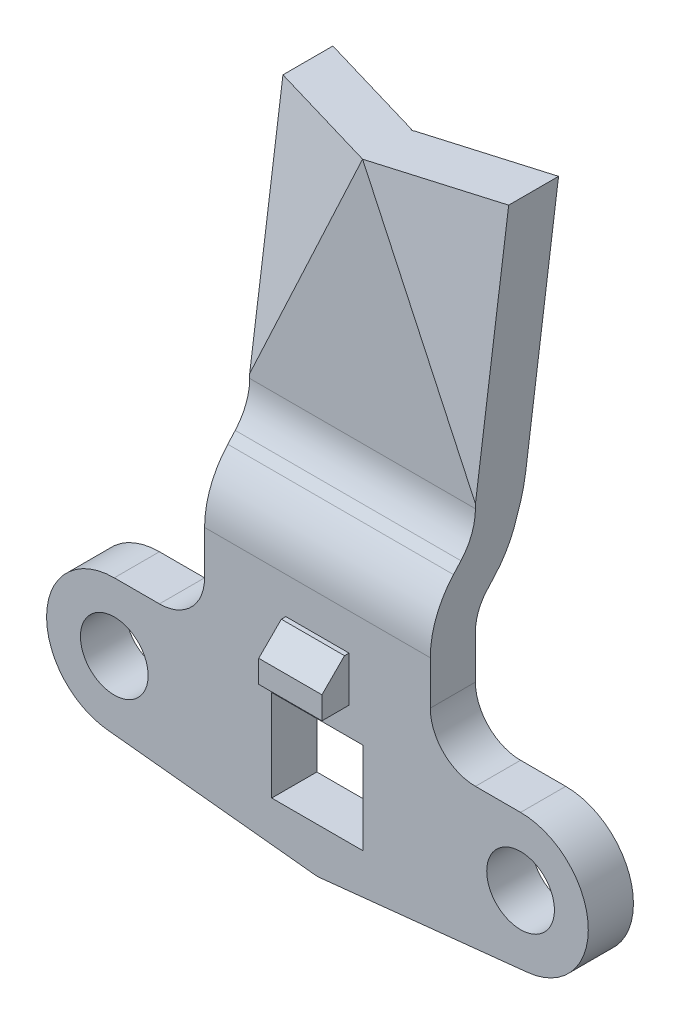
ISO-10303-21;
HEADER;
FILE_DESCRIPTION(('STEP AP214'),'2;1');
FILE_NAME('part.step','',(''),(''),'','','');
FILE_SCHEMA(('AUTOMOTIVE_DESIGN { 1 0 10303 214 1 1 1 1 }'));
ENDSEC;
DATA;
#1=APPLICATION_CONTEXT('core data for automotive mechanical design processes');
#2=APPLICATION_PROTOCOL_DEFINITION('international standard','automotive_design',2000,#1);
#3=PRODUCT_CONTEXT('',#1,'mechanical');
#4=PRODUCT('Part','Part','',(#3));
#5=PRODUCT_RELATED_PRODUCT_CATEGORY('part','',(#4));
#6=PRODUCT_DEFINITION_FORMATION('','',#4);
#7=PRODUCT_DEFINITION_CONTEXT('part definition',#1,'design');
#8=PRODUCT_DEFINITION('design','',#6,#7);
#9=PRODUCT_DEFINITION_SHAPE('','',#8);
#10=(LENGTH_UNIT() NAMED_UNIT(*) SI_UNIT(.MILLI.,.METRE.));
#11=(NAMED_UNIT(*) PLANE_ANGLE_UNIT() SI_UNIT($,.RADIAN.));
#12=(NAMED_UNIT(*) SI_UNIT($,.STERADIAN.) SOLID_ANGLE_UNIT());
#13=UNCERTAINTY_MEASURE_WITH_UNIT(LENGTH_MEASURE(1.E-05),#10,'distance_accuracy_value','');
#14=(GEOMETRIC_REPRESENTATION_CONTEXT(3) GLOBAL_UNCERTAINTY_ASSIGNED_CONTEXT((#13)) GLOBAL_UNIT_ASSIGNED_CONTEXT((#10,
#11,#12)) REPRESENTATION_CONTEXT('',''));
#15=CARTESIAN_POINT('',(0.,0.,0.));
#16=DIRECTION('',(0.,0.,1.));
#17=DIRECTION('',(1.,0.,0.));
#18=AXIS2_PLACEMENT_3D('',#15,#16,#17);
#19=CARTESIAN_POINT('',(-24.,13.7420938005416,0.));
#20=DIRECTION('',(0.,0.,1.));
#21=DIRECTION('',(0.,1.,0.));
#22=AXIS2_PLACEMENT_3D('',#19,#20,#21);
#23=PLANE('',#22);
#24=DIRECTION('',(0.,-1.,0.));
#25=VECTOR('',#24,1.);
#26=CARTESIAN_POINT('',(-2.8,10.5,0.));
#27=LINE('',#26,#25);
#28=CARTESIAN_POINT('',(-2.8,10.5,0.));
#29=VERTEX_POINT('',#28);
#30=CARTESIAN_POINT('',(-2.8,6.5,0.));
#31=VERTEX_POINT('',#30);
#32=EDGE_CURVE('E285',#29,#31,#27,.T.);
#33=ORIENTED_EDGE('',*,*,#32,.F.);
#34=DIRECTION('',(1.,0.,0.));
#35=VECTOR('',#34,1.);
#36=CARTESIAN_POINT('',(-2.8,10.5,0.));
#37=LINE('',#36,#35);
#38=CARTESIAN_POINT('',(2.8,10.5,0.));
#39=VERTEX_POINT('',#38);
#40=EDGE_CURVE('E278',#29,#39,#37,.T.);
#41=ORIENTED_EDGE('',*,*,#40,.T.);
#42=DIRECTION('',(0.,1.,0.));
#43=VECTOR('',#42,1.);
#44=CARTESIAN_POINT('',(2.8,6.5,0.));
#45=LINE('',#44,#43);
#46=CARTESIAN_POINT('',(2.8,6.5,0.));
#47=VERTEX_POINT('',#46);
#48=EDGE_CURVE('E280',#47,#39,#45,.T.);
#49=ORIENTED_EDGE('',*,*,#48,.F.);
#50=DIRECTION('',(-1.,0.,0.));
#51=VECTOR('',#50,1.);
#52=CARTESIAN_POINT('',(2.8,6.5,0.));
#53=LINE('',#52,#51);
#54=EDGE_CURVE('E283',#47,#31,#53,.T.);
#55=ORIENTED_EDGE('',*,*,#54,.T.);
#56=EDGE_LOOP('',(#33,#41,#49,#55));
#57=FACE_BOUND('',#56,.T.);
#58=CARTESIAN_POINT('',(14.,9.87492591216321,0.));
#59=DIRECTION('',(0.,0.,-1.));
#60=DIRECTION('',(0.,-1.,0.));
#61=AXIS2_PLACEMENT_3D('',#58,#59,#60);
#62=CIRCLE('',#61,4.);
#63=CARTESIAN_POINT('',(14.,5.87492591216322,0.));
#64=VERTEX_POINT('',#63);
#65=CARTESIAN_POINT('',(10.,9.87492591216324,0.));
#66=VERTEX_POINT('',#65);
#67=EDGE_CURVE('E362',#64,#66,#62,.T.);
#68=ORIENTED_EDGE('',*,*,#67,.T.);
#69=DIRECTION('',(0.,1.,0.));
#70=VECTOR('',#69,1.);
#71=CARTESIAN_POINT('',(10.,9.87492591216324,0.));
#72=LINE('',#71,#70);
#73=CARTESIAN_POINT('',(10.,13.7420938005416,0.));
#74=VERTEX_POINT('',#73);
#75=EDGE_CURVE('E365',#66,#74,#72,.T.);
#76=ORIENTED_EDGE('',*,*,#75,.T.);
#77=DIRECTION('',(1.,0.,0.));
#78=VECTOR('',#77,1.);
#79=CARTESIAN_POINT('',(-24.,13.7420938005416,0.));
#80=LINE('',#79,#78);
#81=CARTESIAN_POINT('',(-10.,13.7420938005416,0.));
#82=VERTEX_POINT('',#81);
#83=EDGE_CURVE('E614',#82,#74,#80,.T.);
#84=ORIENTED_EDGE('',*,*,#83,.F.);
#85=DIRECTION('',(0.,1.,0.));
#86=VECTOR('',#85,1.);
#87=CARTESIAN_POINT('',(-10.,9.87492591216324,0.));
#88=LINE('',#87,#86);
#89=CARTESIAN_POINT('',(-10.,9.87492591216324,0.));
#90=VERTEX_POINT('',#89);
#91=EDGE_CURVE('E368',#90,#82,#88,.T.);
#92=ORIENTED_EDGE('',*,*,#91,.F.);
#93=CARTESIAN_POINT('',(-14.,9.87492591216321,0.));
#94=DIRECTION('',(0.,0.,1.));
#95=DIRECTION('',(0.,1.,0.));
#96=AXIS2_PLACEMENT_3D('',#93,#94,#95);
#97=CIRCLE('',#96,4.);
#98=CARTESIAN_POINT('',(-14.,5.87492591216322,0.));
#99=VERTEX_POINT('',#98);
#100=EDGE_CURVE('E370',#99,#90,#97,.T.);
#101=ORIENTED_EDGE('',*,*,#100,.F.);
#102=DIRECTION('',(1.,0.,0.));
#103=VECTOR('',#102,1.);
#104=CARTESIAN_POINT('',(-18.,5.87492591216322,0.));
#105=LINE('',#104,#103);
#106=CARTESIAN_POINT('',(-18.,5.87492591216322,0.));
#107=VERTEX_POINT('',#106);
#108=EDGE_CURVE('E373',#107,#99,#105,.T.);
#109=ORIENTED_EDGE('',*,*,#108,.F.);
#110=CARTESIAN_POINT('',(-18.,-0.125074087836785,0.));
#111=DIRECTION('',(0.,0.,1.));
#112=DIRECTION('',(0.,1.,0.));
#113=AXIS2_PLACEMENT_3D('',#110,#111,#112);
#114=CIRCLE('',#113,6.);
#115=CARTESIAN_POINT('',(-18.6271707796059,-6.09220546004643,0.));
#116=VERTEX_POINT('',#115);
#117=EDGE_CURVE('E376',#107,#116,#114,.T.);
#118=ORIENTED_EDGE('',*,*,#117,.T.);
#119=DIRECTION('',(-0.994521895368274,0.10452846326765,0.));
#120=VECTOR('',#119,1.);
#121=CARTESIAN_POINT('',(0.,-8.05,0.));
#122=LINE('',#121,#120);
#123=CARTESIAN_POINT('',(0.,-8.05,0.));
#124=VERTEX_POINT('',#123);
#125=EDGE_CURVE('E378',#124,#116,#122,.T.);
#126=ORIENTED_EDGE('',*,*,#125,.F.);
#127=DIRECTION('',(0.994521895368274,0.10452846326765,0.));
#128=VECTOR('',#127,1.);
#129=CARTESIAN_POINT('',(0.,-8.05,0.));
#130=LINE('',#129,#128);
#131=CARTESIAN_POINT('',(18.6271707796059,-6.09220546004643,0.));
#132=VERTEX_POINT('',#131);
#133=EDGE_CURVE('E353',#124,#132,#130,.T.);
#134=ORIENTED_EDGE('',*,*,#133,.T.);
#135=CARTESIAN_POINT('',(18.,-0.125074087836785,0.));
#136=DIRECTION('',(0.,0.,-1.));
#137=DIRECTION('',(0.,-1.,0.));
#138=AXIS2_PLACEMENT_3D('',#135,#136,#137);
#139=CIRCLE('',#138,6.);
#140=CARTESIAN_POINT('',(18.,5.87492591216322,0.));
#141=VERTEX_POINT('',#140);
#142=EDGE_CURVE('E356',#141,#132,#139,.T.);
#143=ORIENTED_EDGE('',*,*,#142,.F.);
#144=DIRECTION('',(-1.,0.,0.));
#145=VECTOR('',#144,1.);
#146=CARTESIAN_POINT('',(18.,5.87492591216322,0.));
#147=LINE('',#146,#145);
#148=EDGE_CURVE('E359',#141,#64,#147,.T.);
#149=ORIENTED_EDGE('',*,*,#148,.T.);
#150=EDGE_LOOP('',(#68,#76,#84,#92,#101,#109,#118,#126,#134,#143,#149));
#151=FACE_BOUND('',#150,.T.);
#152=DIRECTION('',(0.,1.,0.));
#153=VECTOR('',#152,1.);
#154=CARTESIAN_POINT('',(-4.05,-4.05,0.));
#155=LINE('',#154,#153);
#156=CARTESIAN_POINT('',(-4.05,-4.05,0.));
#157=VERTEX_POINT('',#156);
#158=CARTESIAN_POINT('',(-4.05,4.05,0.));
#159=VERTEX_POINT('',#158);
#160=EDGE_CURVE('E320',#157,#159,#155,.T.);
#161=ORIENTED_EDGE('',*,*,#160,.T.);
#162=DIRECTION('',(-1.,0.,0.));
#163=VECTOR('',#162,1.);
#164=CARTESIAN_POINT('',(4.05,4.05,0.));
#165=LINE('',#164,#163);
#166=CARTESIAN_POINT('',(4.05,4.05,0.));
#167=VERTEX_POINT('',#166);
#168=EDGE_CURVE('E317',#167,#159,#165,.T.);
#169=ORIENTED_EDGE('',*,*,#168,.F.);
#170=DIRECTION('',(0.,-1.,0.));
#171=VECTOR('',#170,1.);
#172=CARTESIAN_POINT('',(4.05,4.05,0.));
#173=LINE('',#172,#171);
#174=CARTESIAN_POINT('',(4.05,-4.05,0.));
#175=VERTEX_POINT('',#174);
#176=EDGE_CURVE('E325',#167,#175,#173,.T.);
#177=ORIENTED_EDGE('',*,*,#176,.T.);
#178=DIRECTION('',(1.,0.,0.));
#179=VECTOR('',#178,1.);
#180=CARTESIAN_POINT('',(-4.05,-4.05,0.));
#181=LINE('',#180,#179);
#182=EDGE_CURVE('E323',#157,#175,#181,.T.);
#183=ORIENTED_EDGE('',*,*,#182,.F.);
#184=EDGE_LOOP('',(#161,#169,#177,#183));
#185=FACE_BOUND('',#184,.T.);
#186=CARTESIAN_POINT('',(-18.,-0.125074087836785,0.));
#187=DIRECTION('',(0.,0.,1.));
#188=DIRECTION('',(0.,1.,0.));
#189=AXIS2_PLACEMENT_3D('',#186,#187,#188);
#190=CIRCLE('',#189,3.);
#191=CARTESIAN_POINT('',(-18.,2.87492591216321,0.));
#192=VERTEX_POINT('',#191);
#193=EDGE_CURVE('E515',#192,#192,#190,.T.);
#194=ORIENTED_EDGE('',*,*,#193,.F.);
#195=EDGE_LOOP('',(#194));
#196=FACE_BOUND('',#195,.T.);
#197=CARTESIAN_POINT('',(18.,-0.125074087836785,0.));
#198=DIRECTION('',(0.,0.,-1.));
#199=DIRECTION('',(0.,-1.,0.));
#200=AXIS2_PLACEMENT_3D('',#197,#198,#199);
#201=CIRCLE('',#200,3.);
#202=CARTESIAN_POINT('',(18.,-3.12507408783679,0.));
#203=VERTEX_POINT('',#202);
#204=EDGE_CURVE('E522',#203,#203,#201,.T.);
#205=ORIENTED_EDGE('',*,*,#204,.T.);
#206=EDGE_LOOP('',(#205));
#207=FACE_BOUND('',#206,.T.);
#208=ADVANCED_FACE('F14',(#57,#151,#185,#196,#207),#23,.T.);
#209=CARTESIAN_POINT('',(-24.,13.7420938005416,-4.));
#210=DIRECTION('',(0.,0.,1.));
#211=DIRECTION('',(0.,1.,0.));
#212=AXIS2_PLACEMENT_3D('',#209,#210,#211);
#213=PLANE('',#212);
#214=DIRECTION('',(-1.,0.,0.));
#215=VECTOR('',#214,1.);
#216=CARTESIAN_POINT('',(4.05,4.05,-4.));
#217=LINE('',#216,#215);
#218=CARTESIAN_POINT('',(4.05,4.05,-4.));
#219=VERTEX_POINT('',#218);
#220=CARTESIAN_POINT('',(-4.05,4.05,-4.));
#221=VERTEX_POINT('',#220);
#222=EDGE_CURVE('E305',#219,#221,#217,.T.);
#223=ORIENTED_EDGE('',*,*,#222,.T.);
#224=DIRECTION('',(0.,1.,0.));
#225=VECTOR('',#224,1.);
#226=CARTESIAN_POINT('',(-4.05,-4.05,-4.));
#227=LINE('',#226,#225);
#228=CARTESIAN_POINT('',(-4.05,-4.05,-4.));
#229=VERTEX_POINT('',#228);
#230=EDGE_CURVE('E308',#229,#221,#227,.T.);
#231=ORIENTED_EDGE('',*,*,#230,.F.);
#232=DIRECTION('',(1.,0.,0.));
#233=VECTOR('',#232,1.);
#234=CARTESIAN_POINT('',(-4.05,-4.05,-4.));
#235=LINE('',#234,#233);
#236=CARTESIAN_POINT('',(4.05,-4.05,-4.));
#237=VERTEX_POINT('',#236);
#238=EDGE_CURVE('E311',#229,#237,#235,.T.);
#239=ORIENTED_EDGE('',*,*,#238,.T.);
#240=DIRECTION('',(0.,-1.,0.));
#241=VECTOR('',#240,1.);
#242=CARTESIAN_POINT('',(4.05,4.05,-4.));
#243=LINE('',#242,#241);
#244=EDGE_CURVE('E314',#219,#237,#243,.T.);
#245=ORIENTED_EDGE('',*,*,#244,.F.);
#246=EDGE_LOOP('',(#223,#231,#239,#245));
#247=FACE_BOUND('',#246,.T.);
#248=DIRECTION('',(0.,1.,0.));
#249=VECTOR('',#248,1.);
#250=CARTESIAN_POINT('',(10.,13.7420938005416,-4.));
#251=LINE('',#250,#249);
#252=CARTESIAN_POINT('',(10.,9.87492591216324,-4.));
#253=VERTEX_POINT('',#252);
#254=CARTESIAN_POINT('',(10.,13.7420938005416,-4.));
#255=VERTEX_POINT('',#254);
#256=EDGE_CURVE('E693',#253,#255,#251,.T.);
#257=ORIENTED_EDGE('',*,*,#256,.F.);
#258=CARTESIAN_POINT('',(14.,9.87492591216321,-4.));
#259=DIRECTION('',(0.,0.,1.));
#260=DIRECTION('',(0.,1.,0.));
#261=AXIS2_PLACEMENT_3D('',#258,#259,#260);
#262=CIRCLE('',#261,4.);
#263=CARTESIAN_POINT('',(14.,5.87492591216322,-4.));
#264=VERTEX_POINT('',#263);
#265=EDGE_CURVE('E729',#264,#253,#262,.F.);
#266=ORIENTED_EDGE('',*,*,#265,.F.);
#267=DIRECTION('',(-1.,0.,0.));
#268=VECTOR('',#267,1.);
#269=CARTESIAN_POINT('',(-24.,5.87492591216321,-4.));
#270=LINE('',#269,#268);
#271=CARTESIAN_POINT('',(18.,5.87492591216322,-4.));
#272=VERTEX_POINT('',#271);
#273=EDGE_CURVE('E709',#272,#264,#270,.T.);
#274=ORIENTED_EDGE('',*,*,#273,.F.);
#275=CARTESIAN_POINT('',(18.,-0.125074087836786,-4.));
#276=DIRECTION('',(0.,0.,1.));
#277=DIRECTION('',(0.,1.,0.));
#278=AXIS2_PLACEMENT_3D('',#275,#276,#277);
#279=CIRCLE('',#278,6.);
#280=CARTESIAN_POINT('',(18.6271707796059,-6.09220546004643,-4.));
#281=VERTEX_POINT('',#280);
#282=EDGE_CURVE('E630',#272,#281,#279,.F.);
#283=ORIENTED_EDGE('',*,*,#282,.T.);
#284=DIRECTION('',(0.994521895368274,0.10452846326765,0.));
#285=VECTOR('',#284,1.);
#286=CARTESIAN_POINT('',(-21.4723556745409,-10.3068355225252,-4.));
#287=LINE('',#286,#285);
#288=CARTESIAN_POINT('',(0.,-8.05,-4.));
#289=VERTEX_POINT('',#288);
#290=EDGE_CURVE('E708',#289,#281,#287,.T.);
#291=ORIENTED_EDGE('',*,*,#290,.F.);
#292=DIRECTION('',(-0.994521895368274,0.10452846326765,0.));
#293=VECTOR('',#292,1.);
#294=CARTESIAN_POINT('',(-26.0031867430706,-5.31695494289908,-4.));
#295=LINE('',#294,#293);
#296=CARTESIAN_POINT('',(-18.6271707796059,-6.09220546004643,-4.));
#297=VERTEX_POINT('',#296);
#298=EDGE_CURVE('E718',#289,#297,#295,.T.);
#299=ORIENTED_EDGE('',*,*,#298,.T.);
#300=CARTESIAN_POINT('',(-18.,-0.125074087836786,-4.));
#301=DIRECTION('',(0.,0.,1.));
#302=DIRECTION('',(0.,1.,0.));
#303=AXIS2_PLACEMENT_3D('',#300,#301,#302);
#304=CIRCLE('',#303,6.);
#305=CARTESIAN_POINT('',(-18.,5.87492591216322,-4.));
#306=VERTEX_POINT('',#305);
#307=EDGE_CURVE('E720',#306,#297,#304,.T.);
#308=ORIENTED_EDGE('',*,*,#307,.F.);
#309=DIRECTION('',(1.,0.,0.));
#310=VECTOR('',#309,1.);
#311=CARTESIAN_POINT('',(-24.,5.87492591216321,-4.));
#312=LINE('',#311,#310);
#313=CARTESIAN_POINT('',(-14.,5.87492591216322,-4.));
#314=VERTEX_POINT('',#313);
#315=EDGE_CURVE('E722',#306,#314,#312,.T.);
#316=ORIENTED_EDGE('',*,*,#315,.T.);
#317=CARTESIAN_POINT('',(-14.,9.87492591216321,-4.));
#318=DIRECTION('',(0.,0.,1.));
#319=DIRECTION('',(0.,1.,0.));
#320=AXIS2_PLACEMENT_3D('',#317,#318,#319);
#321=CIRCLE('',#320,4.);
#322=CARTESIAN_POINT('',(-10.,9.87492591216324,-4.));
#323=VERTEX_POINT('',#322);
#324=EDGE_CURVE('E606',#314,#323,#321,.T.);
#325=ORIENTED_EDGE('',*,*,#324,.T.);
#326=DIRECTION('',(0.,1.,0.));
#327=VECTOR('',#326,1.);
#328=CARTESIAN_POINT('',(-10.,13.7420938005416,-4.));
#329=LINE('',#328,#327);
#330=CARTESIAN_POINT('',(-10.,13.7420938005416,-4.));
#331=VERTEX_POINT('',#330);
#332=EDGE_CURVE('E694',#323,#331,#329,.T.);
#333=ORIENTED_EDGE('',*,*,#332,.T.);
#334=DIRECTION('',(1.,0.,0.));
#335=VECTOR('',#334,1.);
#336=CARTESIAN_POINT('',(-24.,13.7420938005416,-4.));
#337=LINE('',#336,#335);
#338=EDGE_CURVE('E509',#331,#255,#337,.T.);
#339=ORIENTED_EDGE('',*,*,#338,.T.);
#340=EDGE_LOOP('',(#257,#266,#274,#283,#291,#299,#308,#316,#325,#333,#339));
#341=FACE_BOUND('',#340,.T.);
#342=CARTESIAN_POINT('',(-18.,-0.125074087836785,-4.));
#343=DIRECTION('',(0.,0.,1.));
#344=DIRECTION('',(0.,1.,0.));
#345=AXIS2_PLACEMENT_3D('',#342,#343,#344);
#346=CIRCLE('',#345,3.);
#347=CARTESIAN_POINT('',(-18.,2.87492591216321,-4.));
#348=VERTEX_POINT('',#347);
#349=EDGE_CURVE('E257',#348,#348,#346,.T.);
#350=ORIENTED_EDGE('',*,*,#349,.T.);
#351=EDGE_LOOP('',(#350));
#352=FACE_BOUND('',#351,.T.);
#353=CARTESIAN_POINT('',(18.,-0.125074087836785,-4.));
#354=DIRECTION('',(0.,0.,1.));
#355=DIRECTION('',(0.,1.,0.));
#356=AXIS2_PLACEMENT_3D('',#353,#354,#355);
#357=CIRCLE('',#356,3.);
#358=CARTESIAN_POINT('',(18.,2.87492591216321,-4.));
#359=VERTEX_POINT('',#358);
#360=EDGE_CURVE('E18',#359,#359,#357,.F.);
#361=ORIENTED_EDGE('',*,*,#360,.F.);
#362=EDGE_LOOP('',(#361));
#363=FACE_BOUND('',#362,.T.);
#364=ADVANCED_FACE('F451',(#247,#341,#352,#363),#213,.F.);
#365=CARTESIAN_POINT('',(-56.0267452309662,68.0503983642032,-28.0861046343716));
#366=DIRECTION('',(-0.280064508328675,0.130596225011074,0.951056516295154));
#367=DIRECTION('',(-0.959272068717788,0.,-0.282483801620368));
#368=AXIS2_PLACEMENT_3D('',#365,#366,#367);
#369=PLANE('',#368);
#370=DIRECTION('',(-0.0437421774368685,0.987938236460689,-0.14854178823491));
#371=VECTOR('',#370,1.);
#372=CARTESIAN_POINT('',(-1.36672153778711,72.7927650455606,-12.6411786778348));
#373=LINE('',#372,#371);
#374=CARTESIAN_POINT('',(0.,41.9246980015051,-8.));
#375=VERTEX_POINT('',#374);
#376=CARTESIAN_POINT('',(-0.136162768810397,45.,-8.46238807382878));
#377=VERTEX_POINT('',#376);
#378=EDGE_CURVE('E247',#375,#377,#373,.T.);
#379=ORIENTED_EDGE('',*,*,#378,.F.);
#380=DIRECTION('',(0.422618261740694,0.906307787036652,0.));
#381=VECTOR('',#380,1.);
#382=CARTESIAN_POINT('',(2.67659292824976,47.6646700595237,-8.));
#383=LINE('',#382,#381);
#384=CARTESIAN_POINT('',(-8.74323207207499,23.1747763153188,-8.));
#385=VERTEX_POINT('',#384);
#386=EDGE_CURVE('E673',#375,#385,#383,.F.);
#387=ORIENTED_EDGE('',*,*,#386,.T.);
#388=DIRECTION('',(0.861949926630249,-0.401933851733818,0.309016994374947));
#389=VECTOR('',#388,1.);
#390=CARTESIAN_POINT('',(-64.7699773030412,49.3004766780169,-28.0861046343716));
#391=LINE('',#390,#389);
#392=CARTESIAN_POINT('',(-10.,23.7608168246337,-8.45056288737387));
#393=VERTEX_POINT('',#392);
#394=EDGE_CURVE('E662',#393,#385,#391,.T.);
#395=ORIENTED_EDGE('',*,*,#394,.F.);
#396=DIRECTION('',(0.,0.990703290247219,-0.136040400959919));
#397=VECTOR('',#396,1.);
#398=CARTESIAN_POINT('',(-10.,69.8771248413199,-14.7831158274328));
#399=LINE('',#398,#397);
#400=CARTESIAN_POINT('',(-10.,45.,-11.367063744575));
#401=VERTEX_POINT('',#400);
#402=EDGE_CURVE('E635',#393,#401,#399,.T.);
#403=ORIENTED_EDGE('',*,*,#402,.T.);
#404=DIRECTION('',(0.959272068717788,0.,0.282483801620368));
#405=VECTOR('',#404,1.);
#406=CARTESIAN_POINT('',(-56.884450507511,45.,-25.1734678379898));
#407=LINE('',#406,#405);
#408=EDGE_CURVE('E337',#401,#377,#407,.T.);
#409=ORIENTED_EDGE('',*,*,#408,.T.);
#410=EDGE_LOOP('',(#379,#387,#395,#403,#409));
#411=FACE_BOUND('',#410,.T.);
#412=ADVANCED_FACE('F458',(#411),#369,.F.);
#413=CARTESIAN_POINT('',(32.7372831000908,45.,36.));
#414=DIRECTION('',(0.,-1.,0.));
#415=DIRECTION('',(1.,0.,0.));
#416=AXIS2_PLACEMENT_3D('',#413,#414,#415);
#417=PLANE('',#416);
#418=DIRECTION('',(0.959272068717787,0.,-0.28248380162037));
#419=VECTOR('',#418,1.);
#420=CARTESIAN_POINT('',(43.0073509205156,45.,-21.0869777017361));
#421=LINE('',#420,#419);
#422=CARTESIAN_POINT('',(0.136162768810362,45.,-8.46238807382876));
#423=VERTEX_POINT('',#422);
#424=CARTESIAN_POINT('',(10.,45.,-11.367063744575));
#425=VERTEX_POINT('',#424);
#426=EDGE_CURVE('E339',#423,#425,#421,.T.);
#427=ORIENTED_EDGE('',*,*,#426,.F.);
#428=DIRECTION('',(-0.282483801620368,0.,0.959272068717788));
#429=VECTOR('',#428,1.);
#430=CARTESIAN_POINT('',(-9.31072791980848,45.,23.6178173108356));
#431=LINE('',#430,#429);
#432=CARTESIAN_POINT('',(0.114431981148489,45.,-8.38859362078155));
#433=VERTEX_POINT('',#432);
#434=EDGE_CURVE('E23',#423,#433,#431,.T.);
#435=ORIENTED_EDGE('',*,*,#434,.T.);
#436=CARTESIAN_POINT('',(0.,45.,-8.42229123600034));
#437=VERTEX_POINT('',#436);
#438=EDGE_CURVE('E262',#437,#433,#407,.T.);
#439=ORIENTED_EDGE('',*,*,#438,.F.);
#440=DIRECTION('',(-0.959272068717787,0.,0.28248380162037));
#441=VECTOR('',#440,1.);
#442=CARTESIAN_POINT('',(18.0874428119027,45.,-13.7486316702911));
#443=LINE('',#442,#441);
#444=CARTESIAN_POINT('',(-0.11443198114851,45.,-8.38859362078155));
#445=VERTEX_POINT('',#444);
#446=EDGE_CURVE('E255',#437,#445,#443,.T.);
#447=ORIENTED_EDGE('',*,*,#446,.T.);
#448=DIRECTION('',(0.28248380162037,0.,0.959272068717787));
#449=VECTOR('',#448,1.);
#450=CARTESIAN_POINT('',(14.5354083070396,45.,41.3600380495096));
#451=LINE('',#450,#449);
#452=EDGE_CURVE('E241',#377,#445,#451,.T.);
#453=ORIENTED_EDGE('',*,*,#452,.F.);
#454=ORIENTED_EDGE('',*,*,#408,.F.);
#455=DIRECTION('',(0.,0.,-1.));
#456=VECTOR('',#455,1.);
#457=CARTESIAN_POINT('',(-10.,45.,-60.));
#458=LINE('',#457,#456);
#459=CARTESIAN_POINT('',(-10.,45.,-6.94477250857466));
#460=VERTEX_POINT('',#459);
#461=EDGE_CURVE('E344',#460,#401,#458,.T.);
#462=ORIENTED_EDGE('',*,*,#461,.F.);
#463=DIRECTION('',(-0.959272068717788,0.,-0.282483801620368));
#464=VECTOR('',#463,1.);
#465=CARTESIAN_POINT('',(-66.364034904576,45.,-23.5426985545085));
#466=LINE('',#465,#464);
#467=CARTESIAN_POINT('',(0.,45.,-4.));
#468=VERTEX_POINT('',#467);
#469=EDGE_CURVE('E347',#468,#460,#466,.T.);
#470=ORIENTED_EDGE('',*,*,#469,.F.);
#471=DIRECTION('',(-0.959272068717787,0.,0.282483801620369));
#472=VECTOR('',#471,1.);
#473=CARTESIAN_POINT('',(44.4413877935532,45.,-17.0869777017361));
#474=LINE('',#473,#472);
#475=CARTESIAN_POINT('',(10.,45.,-6.94477250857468));
#476=VERTEX_POINT('',#475);
#477=EDGE_CURVE('E350',#476,#468,#474,.T.);
#478=ORIENTED_EDGE('',*,*,#477,.F.);
#479=DIRECTION('',(0.,0.,-1.));
#480=VECTOR('',#479,1.);
#481=CARTESIAN_POINT('',(10.,45.,-60.));
#482=LINE('',#481,#480);
#483=EDGE_CURVE('E342',#476,#425,#482,.T.);
#484=ORIENTED_EDGE('',*,*,#483,.T.);
#485=EDGE_LOOP('',(#427,#435,#439,#447,#453,#454,#462,#470,#478,#484));
#486=FACE_BOUND('',#485,.T.);
#487=ADVANCED_FACE('F260',(#486),#417,.F.);
#488=CARTESIAN_POINT('',(-2.8,10.5,2.4));
#489=DIRECTION('',(0.,1.,0.));
#490=DIRECTION('',(0.,0.,-1.));
#491=AXIS2_PLACEMENT_3D('',#488,#489,#490);
#492=PLANE('',#491);
#493=DIRECTION('',(0.,0.,-1.));
#494=VECTOR('',#493,1.);
#495=CARTESIAN_POINT('',(-2.8,10.5,2.4));
#496=LINE('',#495,#494);
#497=CARTESIAN_POINT('',(-2.8,10.5,0.4));
#498=VERTEX_POINT('',#497);
#499=EDGE_CURVE('E303',#498,#29,#496,.T.);
#500=ORIENTED_EDGE('',*,*,#499,.F.);
#501=DIRECTION('',(-1.,0.,0.));
#502=VECTOR('',#501,1.);
#503=CARTESIAN_POINT('',(24.,10.5,0.4));
#504=LINE('',#503,#502);
#505=CARTESIAN_POINT('',(2.8,10.5,0.4));
#506=VERTEX_POINT('',#505);
#507=EDGE_CURVE('E272',#506,#498,#504,.T.);
#508=ORIENTED_EDGE('',*,*,#507,.F.);
#509=DIRECTION('',(0.,0.,-1.));
#510=VECTOR('',#509,1.);
#511=CARTESIAN_POINT('',(2.8,10.5,2.4));
#512=LINE('',#511,#510);
#513=EDGE_CURVE('E39',#506,#39,#512,.T.);
#514=ORIENTED_EDGE('',*,*,#513,.T.);
#515=ORIENTED_EDGE('',*,*,#40,.F.);
#516=EDGE_LOOP('',(#500,#508,#514,#515));
#517=FACE_BOUND('',#516,.T.);
#518=ADVANCED_FACE('F553',(#517),#492,.T.);
#519=CARTESIAN_POINT('',(-2.8,10.5,2.4));
#520=DIRECTION('',(1.,0.,0.));
#521=DIRECTION('',(0.,1.,0.));
#522=AXIS2_PLACEMENT_3D('',#519,#520,#521);
#523=PLANE('',#522);
#524=DIRECTION('',(0.,0.707106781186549,-0.707106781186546));
#525=VECTOR('',#524,1.);
#526=CARTESIAN_POINT('',(-2.8,8.5,2.4));
#527=LINE('',#526,#525);
#528=CARTESIAN_POINT('',(-2.8,8.5,2.4));
#529=VERTEX_POINT('',#528);
#530=EDGE_CURVE('E31',#529,#498,#527,.T.);
#531=ORIENTED_EDGE('',*,*,#530,.T.);
#532=ORIENTED_EDGE('',*,*,#499,.T.);
#533=ORIENTED_EDGE('',*,*,#32,.T.);
#534=DIRECTION('',(0.,0.,-1.));
#535=VECTOR('',#534,1.);
#536=CARTESIAN_POINT('',(-2.8,6.5,2.4));
#537=LINE('',#536,#535);
#538=CARTESIAN_POINT('',(-2.8,6.5,2.4));
#539=VERTEX_POINT('',#538);
#540=EDGE_CURVE('E300',#539,#31,#537,.T.);
#541=ORIENTED_EDGE('',*,*,#540,.F.);
#542=DIRECTION('',(0.,-1.,0.));
#543=VECTOR('',#542,1.);
#544=CARTESIAN_POINT('',(-2.8,10.5,2.4));
#545=LINE('',#544,#543);
#546=EDGE_CURVE('E294',#529,#539,#545,.T.);
#547=ORIENTED_EDGE('',*,*,#546,.F.);
#548=EDGE_LOOP('',(#531,#532,#533,#541,#547));
#549=FACE_BOUND('',#548,.T.);
#550=ADVANCED_FACE('F556',(#549),#523,.F.);
#551=CARTESIAN_POINT('',(2.8,6.5,2.4));
#552=DIRECTION('',(-1.,0.,0.));
#553=DIRECTION('',(0.,-1.,0.));
#554=AXIS2_PLACEMENT_3D('',#551,#552,#553);
#555=PLANE('',#554);
#556=DIRECTION('',(0.,0.707106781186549,-0.707106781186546));
#557=VECTOR('',#556,1.);
#558=CARTESIAN_POINT('',(2.8,7.5,3.4));
#559=LINE('',#558,#557);
#560=CARTESIAN_POINT('',(2.8,8.5,2.4));
#561=VERTEX_POINT('',#560);
#562=EDGE_CURVE('E276',#561,#506,#559,.T.);
#563=ORIENTED_EDGE('',*,*,#562,.F.);
#564=DIRECTION('',(0.,1.,0.));
#565=VECTOR('',#564,1.);
#566=CARTESIAN_POINT('',(2.8,6.5,2.4));
#567=LINE('',#566,#565);
#568=CARTESIAN_POINT('',(2.8,6.5,2.4));
#569=VERTEX_POINT('',#568);
#570=EDGE_CURVE('E288',#569,#561,#567,.T.);
#571=ORIENTED_EDGE('',*,*,#570,.F.);
#572=DIRECTION('',(0.,0.,-1.));
#573=VECTOR('',#572,1.);
#574=CARTESIAN_POINT('',(2.8,6.5,2.4));
#575=LINE('',#574,#573);
#576=EDGE_CURVE('E297',#569,#47,#575,.T.);
#577=ORIENTED_EDGE('',*,*,#576,.T.);
#578=ORIENTED_EDGE('',*,*,#48,.T.);
#579=ORIENTED_EDGE('',*,*,#513,.F.);
#580=EDGE_LOOP('',(#563,#571,#577,#578,#579));
#581=FACE_BOUND('',#580,.T.);
#582=ADVANCED_FACE('F483',(#581),#555,.F.);
#583=CARTESIAN_POINT('',(2.8,10.5,2.4));
#584=DIRECTION('',(0.,0.,1.));
#585=DIRECTION('',(-1.,0.,0.));
#586=AXIS2_PLACEMENT_3D('',#583,#584,#585);
#587=PLANE('',#586);
#588=ORIENTED_EDGE('',*,*,#570,.T.);
#589=DIRECTION('',(-1.,0.,0.));
#590=VECTOR('',#589,1.);
#591=CARTESIAN_POINT('',(24.,8.5,2.4));
#592=LINE('',#591,#590);
#593=EDGE_CURVE('E274',#561,#529,#592,.T.);
#594=ORIENTED_EDGE('',*,*,#593,.T.);
#595=ORIENTED_EDGE('',*,*,#546,.T.);
#596=DIRECTION('',(-1.,0.,0.));
#597=VECTOR('',#596,1.);
#598=CARTESIAN_POINT('',(2.8,6.5,2.4));
#599=LINE('',#598,#597);
#600=EDGE_CURVE('E291',#569,#539,#599,.T.);
#601=ORIENTED_EDGE('',*,*,#600,.F.);
#602=EDGE_LOOP('',(#588,#594,#595,#601));
#603=FACE_BOUND('',#602,.T.);
#604=ADVANCED_FACE('F477',(#603),#587,.T.);
#605=CARTESIAN_POINT('',(-24.,23.1747763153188,1.));
#606=DIRECTION('',(1.,0.,0.));
#607=DIRECTION('',(0.,1.,0.));
#608=AXIS2_PLACEMENT_3D('',#605,#606,#607);
#609=CYLINDRICAL_SURFACE('',#608,9.);
#610=CARTESIAN_POINT('',(10.,23.1747763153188,1.));
#611=DIRECTION('',(1.,0.,0.));
#612=DIRECTION('',(0.,1.,0.));
#613=AXIS2_PLACEMENT_3D('',#610,#611,#612);
#614=CIRCLE('',#613,9.);
#615=CARTESIAN_POINT('',(10.,17.152600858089,-5.68830342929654));
#616=VERTEX_POINT('',#615);
#617=CARTESIAN_POINT('',(10.,20.7380635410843,-7.66385773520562));
#618=VERTEX_POINT('',#617);
#619=EDGE_CURVE('E489',#616,#618,#614,.T.);
#620=ORIENTED_EDGE('',*,*,#619,.F.);
#621=DIRECTION('',(1.,0.,0.));
#622=VECTOR('',#621,1.);
#623=CARTESIAN_POINT('',(-24.,17.152600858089,-5.68830342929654));
#624=LINE('',#623,#622);
#625=CARTESIAN_POINT('',(-10.,17.152600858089,-5.68830342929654));
#626=VERTEX_POINT('',#625);
#627=EDGE_CURVE('E492',#626,#616,#624,.T.);
#628=ORIENTED_EDGE('',*,*,#627,.F.);
#629=CARTESIAN_POINT('',(-10.,23.1747763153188,1.));
#630=DIRECTION('',(1.,0.,0.));
#631=DIRECTION('',(0.,1.,0.));
#632=AXIS2_PLACEMENT_3D('',#629,#630,#631);
#633=CIRCLE('',#632,9.);
#634=CARTESIAN_POINT('',(-10.,20.7380635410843,-7.66385773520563));
#635=VERTEX_POINT('',#634);
#636=EDGE_CURVE('E645',#626,#635,#633,.T.);
#637=ORIENTED_EDGE('',*,*,#636,.T.);
#638=CARTESIAN_POINT('',(-11.9698150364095,23.1747763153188,1.));
#639=DIRECTION('',(0.861949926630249,-0.401933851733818,0.309016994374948));
#640=DIRECTION('',(0.506993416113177,0.683336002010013,-0.52536614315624));
#641=AXIS2_PLACEMENT_3D('',#638,#639,#640);
#642=ELLIPSE('',#641,10.4414418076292,9.);
#643=EDGE_CURVE('E676',#385,#635,#642,.F.);
#644=ORIENTED_EDGE('',*,*,#643,.F.);
#645=DIRECTION('',(1.,0.,0.));
#646=VECTOR('',#645,1.);
#647=CARTESIAN_POINT('',(-24.,23.1747763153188,-8.));
#648=LINE('',#647,#646);
#649=CARTESIAN_POINT('',(8.743232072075,23.1747763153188,-8.));
#650=VERTEX_POINT('',#649);
#651=EDGE_CURVE('E504',#385,#650,#648,.T.);
#652=ORIENTED_EDGE('',*,*,#651,.T.);
#653=CARTESIAN_POINT('',(11.9698150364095,23.1747763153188,1.));
#654=DIRECTION('',(-0.861949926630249,-0.401933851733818,0.309016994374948));
#655=DIRECTION('',(0.506993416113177,-0.683336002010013,0.52536614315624));
#656=AXIS2_PLACEMENT_3D('',#653,#654,#655);
#657=ELLIPSE('',#656,10.4414418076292,9.);
#658=EDGE_CURVE('E495',#650,#618,#657,.T.);
#659=ORIENTED_EDGE('',*,*,#658,.T.);
#660=EDGE_LOOP('',(#620,#628,#637,#644,#652,#659));
#661=FACE_BOUND('',#660,.T.);
#662=ADVANCED_FACE('F474',(#661),#609,.T.);
#663=CARTESIAN_POINT('',(-24.,17.152600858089,-5.68830342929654));
#664=DIRECTION('',(0.,0.669130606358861,0.743144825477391));
#665=DIRECTION('',(0.,0.743144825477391,-0.669130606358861));
#666=AXIS2_PLACEMENT_3D('',#663,#664,#665);
#667=PLANE('',#666);
#668=DIRECTION('',(0.,0.743144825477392,-0.669130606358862));
#669=VECTOR('',#668,1.);
#670=CARTESIAN_POINT('',(10.,17.152600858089,-5.68830342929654));
#671=LINE('',#670,#669);
#672=CARTESIAN_POINT('',(10.,16.418616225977,-5.02742069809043));
#673=VERTEX_POINT('',#672);
#674=EDGE_CURVE('E501',#673,#616,#671,.T.);
#675=ORIENTED_EDGE('',*,*,#674,.F.);
#676=DIRECTION('',(1.,0.,0.));
#677=VECTOR('',#676,1.);
#678=CARTESIAN_POINT('',(-24.,16.418616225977,-5.02742069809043));
#679=LINE('',#678,#677);
#680=CARTESIAN_POINT('',(-10.,16.418616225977,-5.02742069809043));
#681=VERTEX_POINT('',#680);
#682=EDGE_CURVE('E505',#681,#673,#679,.T.);
#683=ORIENTED_EDGE('',*,*,#682,.F.);
#684=DIRECTION('',(0.,0.743144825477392,-0.669130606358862));
#685=VECTOR('',#684,1.);
#686=CARTESIAN_POINT('',(-10.,17.152600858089,-5.68830342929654));
#687=LINE('',#686,#685);
#688=EDGE_CURVE('E503',#681,#626,#687,.T.);
#689=ORIENTED_EDGE('',*,*,#688,.T.);
#690=ORIENTED_EDGE('',*,*,#627,.T.);
#691=EDGE_LOOP('',(#675,#683,#689,#690));
#692=FACE_BOUND('',#691,.T.);
#693=ADVANCED_FACE('F472',(#692),#667,.F.);
#694=CARTESIAN_POINT('',(-24.,45.,-4.));
#695=DIRECTION('',(0.,0.,1.));
#696=DIRECTION('',(-1.,0.,0.));
#697=AXIS2_PLACEMENT_3D('',#694,#695,#696);
#698=PLANE('',#697);
#699=DIRECTION('',(1.,0.,0.));
#700=VECTOR('',#699,1.);
#701=CARTESIAN_POINT('',(-24.,23.1747763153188,-4.));
#702=LINE('',#701,#700);
#703=CARTESIAN_POINT('',(-10.,23.1747763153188,-4.));
#704=VERTEX_POINT('',#703);
#705=CARTESIAN_POINT('',(10.,23.1747763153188,-4.));
#706=VERTEX_POINT('',#705);
#707=EDGE_CURVE('E680',#704,#706,#702,.T.);
#708=ORIENTED_EDGE('',*,*,#707,.T.);
#709=DIRECTION('',(0.,1.,0.));
#710=VECTOR('',#709,1.);
#711=CARTESIAN_POINT('',(10.,45.,-4.));
#712=LINE('',#711,#710);
#713=CARTESIAN_POINT('',(10.,23.554930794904,-4.));
#714=VERTEX_POINT('',#713);
#715=EDGE_CURVE('E414',#706,#714,#712,.T.);
#716=ORIENTED_EDGE('',*,*,#715,.T.);
#717=DIRECTION('',(0.422618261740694,-0.906307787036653,0.));
#718=VECTOR('',#717,1.);
#719=CARTESIAN_POINT('',(0.,45.,-4.));
#720=LINE('',#719,#718);
#721=EDGE_CURVE('E664',#468,#714,#720,.T.);
#722=ORIENTED_EDGE('',*,*,#721,.F.);
#723=DIRECTION('',(-0.422618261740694,-0.906307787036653,0.));
#724=VECTOR('',#723,1.);
#725=CARTESIAN_POINT('',(0.,45.,-4.));
#726=LINE('',#725,#724);
#727=CARTESIAN_POINT('',(-10.,23.554930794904,-4.));
#728=VERTEX_POINT('',#727);
#729=EDGE_CURVE('E667',#468,#728,#726,.T.);
#730=ORIENTED_EDGE('',*,*,#729,.T.);
#731=DIRECTION('',(0.,1.,0.));
#732=VECTOR('',#731,1.);
#733=CARTESIAN_POINT('',(-10.,45.,-4.));
#734=LINE('',#733,#732);
#735=EDGE_CURVE('E624',#704,#728,#734,.T.);
#736=ORIENTED_EDGE('',*,*,#735,.F.);
#737=EDGE_LOOP('',(#708,#716,#722,#730,#736));
#738=FACE_BOUND('',#737,.T.);
#739=ADVANCED_FACE('F470',(#738),#698,.T.);
#740=CARTESIAN_POINT('',(-24.,13.7420938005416,-8.));
#741=DIRECTION('',(1.,0.,0.));
#742=DIRECTION('',(0.,1.,0.));
#743=AXIS2_PLACEMENT_3D('',#740,#741,#742);
#744=CYLINDRICAL_SURFACE('',#743,4.);
#745=CARTESIAN_POINT('',(10.,13.7420938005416,-8.));
#746=DIRECTION('',(1.,0.,0.));
#747=DIRECTION('',(0.,1.,0.));
#748=AXIS2_PLACEMENT_3D('',#745,#746,#747);
#749=CIRCLE('',#748,4.);
#750=EDGE_CURVE('E698',#255,#673,#749,.F.);
#751=ORIENTED_EDGE('',*,*,#750,.F.);
#752=ORIENTED_EDGE('',*,*,#338,.F.);
#753=CARTESIAN_POINT('',(-10.,13.7420938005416,-8.));
#754=DIRECTION('',(1.,0.,0.));
#755=DIRECTION('',(0.,1.,0.));
#756=AXIS2_PLACEMENT_3D('',#753,#754,#755);
#757=CIRCLE('',#756,4.);
#758=EDGE_CURVE('E697',#331,#681,#757,.F.);
#759=ORIENTED_EDGE('',*,*,#758,.T.);
#760=ORIENTED_EDGE('',*,*,#682,.T.);
#761=EDGE_LOOP('',(#751,#752,#759,#760));
#762=FACE_BOUND('',#761,.T.);
#763=ADVANCED_FACE('F467',(#762),#744,.F.);
#764=CARTESIAN_POINT('',(-24.,13.7420938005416,-8.));
#765=DIRECTION('',(1.,0.,0.));
#766=DIRECTION('',(0.,1.,0.));
#767=AXIS2_PLACEMENT_3D('',#764,#765,#766);
#768=CYLINDRICAL_SURFACE('',#767,8.);
#769=ORIENTED_EDGE('',*,*,#83,.T.);
#770=CARTESIAN_POINT('',(10.,13.7420938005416,-8.));
#771=DIRECTION('',(1.,0.,0.));
#772=DIRECTION('',(0.,1.,0.));
#773=AXIS2_PLACEMENT_3D('',#770,#771,#772);
#774=CIRCLE('',#773,8.);
#775=CARTESIAN_POINT('',(10.,19.0951386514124,-2.05484139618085));
#776=VERTEX_POINT('',#775);
#777=EDGE_CURVE('E701',#74,#776,#774,.F.);
#778=ORIENTED_EDGE('',*,*,#777,.T.);
#779=DIRECTION('',(1.,0.,0.));
#780=VECTOR('',#779,1.);
#781=CARTESIAN_POINT('',(-24.,19.0951386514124,-2.05484139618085));
#782=LINE('',#781,#780);
#783=CARTESIAN_POINT('',(-10.,19.0951386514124,-2.05484139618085));
#784=VERTEX_POINT('',#783);
#785=EDGE_CURVE('E623',#784,#776,#782,.T.);
#786=ORIENTED_EDGE('',*,*,#785,.F.);
#787=CARTESIAN_POINT('',(-10.,13.7420938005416,-8.));
#788=DIRECTION('',(1.,0.,0.));
#789=DIRECTION('',(0.,1.,0.));
#790=AXIS2_PLACEMENT_3D('',#787,#788,#789);
#791=CIRCLE('',#790,8.);
#792=EDGE_CURVE('E617',#82,#784,#791,.F.);
#793=ORIENTED_EDGE('',*,*,#792,.F.);
#794=EDGE_LOOP('',(#769,#778,#786,#793));
#795=FACE_BOUND('',#794,.T.);
#796=ADVANCED_FACE('F464',(#795),#768,.T.);
#797=CARTESIAN_POINT('',(-24.,19.8291232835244,-2.71572412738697));
#798=DIRECTION('',(0.,0.669130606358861,0.743144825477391));
#799=DIRECTION('',(0.,0.743144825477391,-0.669130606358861));
#800=AXIS2_PLACEMENT_3D('',#797,#798,#799);
#801=PLANE('',#800);
#802=ORIENTED_EDGE('',*,*,#785,.T.);
#803=DIRECTION('',(0.,0.743144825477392,-0.669130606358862));
#804=VECTOR('',#803,1.);
#805=CARTESIAN_POINT('',(10.,19.8291232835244,-2.71572412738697));
#806=LINE('',#805,#804);
#807=CARTESIAN_POINT('',(10.,19.8291232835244,-2.71572412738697));
#808=VERTEX_POINT('',#807);
#809=EDGE_CURVE('E738',#776,#808,#806,.T.);
#810=ORIENTED_EDGE('',*,*,#809,.T.);
#811=DIRECTION('',(1.,0.,0.));
#812=VECTOR('',#811,1.);
#813=CARTESIAN_POINT('',(-24.,19.8291232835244,-2.71572412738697));
#814=LINE('',#813,#812);
#815=CARTESIAN_POINT('',(-10.,19.8291232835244,-2.71572412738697));
#816=VERTEX_POINT('',#815);
#817=EDGE_CURVE('E683',#816,#808,#814,.T.);
#818=ORIENTED_EDGE('',*,*,#817,.F.);
#819=DIRECTION('',(0.,0.743144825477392,-0.669130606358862));
#820=VECTOR('',#819,1.);
#821=CARTESIAN_POINT('',(-10.,19.8291232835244,-2.71572412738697));
#822=LINE('',#821,#820);
#823=EDGE_CURVE('E625',#784,#816,#822,.T.);
#824=ORIENTED_EDGE('',*,*,#823,.F.);
#825=EDGE_LOOP('',(#802,#810,#818,#824));
#826=FACE_BOUND('',#825,.T.);
#827=ADVANCED_FACE('F753',(#826),#801,.T.);
#828=CARTESIAN_POINT('',(-24.,23.1747763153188,1.));
#829=DIRECTION('',(1.,0.,0.));
#830=DIRECTION('',(0.,1.,0.));
#831=AXIS2_PLACEMENT_3D('',#828,#829,#830);
#832=CYLINDRICAL_SURFACE('',#831,5.);
#833=ORIENTED_EDGE('',*,*,#817,.T.);
#834=CARTESIAN_POINT('',(10.,23.1747763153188,1.));
#835=DIRECTION('',(1.,0.,0.));
#836=DIRECTION('',(0.,1.,0.));
#837=AXIS2_PLACEMENT_3D('',#834,#835,#836);
#838=CIRCLE('',#837,5.);
#839=EDGE_CURVE('E497',#808,#706,#838,.T.);
#840=ORIENTED_EDGE('',*,*,#839,.T.);
#841=ORIENTED_EDGE('',*,*,#707,.F.);
#842=CARTESIAN_POINT('',(-10.,23.1747763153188,1.));
#843=DIRECTION('',(1.,0.,0.));
#844=DIRECTION('',(0.,1.,0.));
#845=AXIS2_PLACEMENT_3D('',#842,#843,#844);
#846=CIRCLE('',#845,5.);
#847=EDGE_CURVE('E507',#816,#704,#846,.T.);
#848=ORIENTED_EDGE('',*,*,#847,.F.);
#849=EDGE_LOOP('',(#833,#840,#841,#848));
#850=FACE_BOUND('',#849,.T.);
#851=ADVANCED_FACE('F744',(#850),#832,.F.);
#852=CARTESIAN_POINT('',(46.4478121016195,39.2521303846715,-11.3606797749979));
#853=DIRECTION('',(0.861949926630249,0.401933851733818,-0.309016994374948));
#854=DIRECTION('',(0.506993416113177,-0.683336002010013,0.525366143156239));
#855=AXIS2_PLACEMENT_3D('',#852,#853,#854);
#856=ELLIPSE('',#855,10.4414418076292,9.);
#857=DIRECTION('',(-0.861949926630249,-0.401933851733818,0.309016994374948));
#858=VECTOR('',#857,1.);
#859=SURFACE_OF_LINEAR_EXTRUSION('',#856,#858);
#860=CARTESIAN_POINT('',(10.,20.7380635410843,-7.66385773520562));
#861=CARTESIAN_POINT('',(10.,20.8357922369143,-7.701309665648));
#862=CARTESIAN_POINT('',(10.,20.9339184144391,-7.73772648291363));
#863=CARTESIAN_POINT('',(10.,21.1307328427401,-7.80837199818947));
#864=CARTESIAN_POINT('',(10.,21.2294195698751,-7.84260494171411));
#865=CARTESIAN_POINT('',(10.,21.4273614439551,-7.90886419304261));
#866=CARTESIAN_POINT('',(10.,21.5266154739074,-7.94089383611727));
#867=CARTESIAN_POINT('',(10.,21.7256996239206,-8.00272226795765));
#868=CARTESIAN_POINT('',(10.,21.8255290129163,-8.03252340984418));
#869=CARTESIAN_POINT('',(10.,22.0257734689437,-8.08986531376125));
#870=CARTESIAN_POINT('',(10.,22.1261881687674,-8.11740735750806));
#871=CARTESIAN_POINT('',(10.,22.3276342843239,-8.17020077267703));
#872=CARTESIAN_POINT('',(10.,22.4286657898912,-8.19545180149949));
#873=CARTESIAN_POINT('',(10.,22.6313363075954,-8.24361460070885));
#874=CARTESIAN_POINT('',(10.,22.7329755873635,-8.26652524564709));
#875=CARTESIAN_POINT('',(10.,22.9368716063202,-8.30995760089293));
#876=CARTESIAN_POINT('',(10.,23.0391288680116,-8.33047685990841));
#877=CARTESIAN_POINT('',(10.,23.2442725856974,-8.36906975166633));
#878=CARTESIAN_POINT('',(10.,23.3471597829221,-8.38713944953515));
#879=CARTESIAN_POINT('',(10.,23.5535757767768,-8.42076798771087));
#880=CARTESIAN_POINT('',(10.,23.6571054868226,-8.43632121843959));
#881=CARTESIAN_POINT('',(10.,23.7608168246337,-8.45056288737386));
#882=B_SPLINE_CURVE_WITH_KNOTS('',3,(#860,#861,#862,#863,#864,#865,#866,#867,#868,#869,#870,
#871,#872,#873,#874,#875,#876,#877,#878,#879,#880,#881),.UNSPECIFIED.,.F.,.F.,(4,2,2,2,2,2,2,2,
2,2,4),(0.,0.313972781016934,0.62731531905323,0.940172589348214,1.25269470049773,
1.56503825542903,1.87742844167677,2.18996815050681,2.50282546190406,2.81617952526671,
3.13022275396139),.UNSPECIFIED.);
#883=CARTESIAN_POINT('',(10.,23.7608168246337,-8.45056288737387));
#884=VERTEX_POINT('',#883);
#885=EDGE_CURVE('E406',#618,#884,#882,.T.);
#886=ORIENTED_EDGE('',*,*,#885,.F.);
#887=ORIENTED_EDGE('',*,*,#658,.F.);
#888=DIRECTION('',(-0.861949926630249,-0.401933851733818,0.309016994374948));
#889=VECTOR('',#888,1.);
#890=CARTESIAN_POINT('',(43.221229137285,39.2521303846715,-20.360679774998));
#891=LINE('',#890,#889);
#892=EDGE_CURVE('E661',#884,#650,#891,.T.);
#893=ORIENTED_EDGE('',*,*,#892,.F.);
#894=EDGE_LOOP('',(#886,#887,#893));
#895=FACE_BOUND('',#894,.T.);
#896=ADVANCED_FACE('F416',(#895),#859,.F.);
#897=CARTESIAN_POINT('',(44.6552660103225,39.2521303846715,-16.3606797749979));
#898=DIRECTION('',(-0.280064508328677,-0.130596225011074,-0.951056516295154));
#899=DIRECTION('',(0.959272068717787,0.,-0.282483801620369));
#900=AXIS2_PLACEMENT_3D('',#897,#898,#899);
#901=PLANE('',#900);
#902=DIRECTION('',(0.,-0.990703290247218,0.13604040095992));
#903=VECTOR('',#902,1.);
#904=CARTESIAN_POINT('',(10.,40.6275413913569,-6.34435962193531));
#905=LINE('',#904,#903);
#906=EDGE_CURVE('E404',#476,#714,#905,.T.);
#907=ORIENTED_EDGE('',*,*,#906,.F.);
#908=ORIENTED_EDGE('',*,*,#477,.T.);
#909=ORIENTED_EDGE('',*,*,#721,.T.);
#910=EDGE_LOOP('',(#907,#908,#909));
#911=FACE_BOUND('',#910,.T.);
#912=ADVANCED_FACE('F772',(#911),#901,.F.);
#913=CARTESIAN_POINT('',(43.221229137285,39.2521303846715,-20.360679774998));
#914=DIRECTION('',(0.280064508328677,0.130596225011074,0.951056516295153));
#915=DIRECTION('',(-0.959272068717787,0.,0.28248380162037));
#916=AXIS2_PLACEMENT_3D('',#913,#914,#915);
#917=PLANE('',#916);
#918=DIRECTION('',(0.422618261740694,-0.906307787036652,0.));
#919=VECTOR('',#918,1.);
#920=CARTESIAN_POINT('',(-3.50944729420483,49.4507320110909,-8.));
#921=LINE('',#920,#919);
#922=EDGE_CURVE('E670',#375,#650,#921,.T.);
#923=ORIENTED_EDGE('',*,*,#922,.F.);
#924=DIRECTION('',(-0.0437421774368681,-0.987938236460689,0.14854178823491));
#925=VECTOR('',#924,1.);
#926=CARTESIAN_POINT('',(0.00321521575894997,41.9973152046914,-8.0109183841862));
#927=LINE('',#926,#925);
#928=EDGE_CURVE('E9',#423,#375,#927,.T.);
#929=ORIENTED_EDGE('',*,*,#928,.F.);
#930=ORIENTED_EDGE('',*,*,#426,.T.);
#931=DIRECTION('',(0.,0.990703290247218,-0.13604040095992));
#932=VECTOR('',#931,1.);
#933=CARTESIAN_POINT('',(10.,40.5706268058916,-10.7588355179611));
#934=LINE('',#933,#932);
#935=EDGE_CURVE('E401',#884,#425,#934,.T.);
#936=ORIENTED_EDGE('',*,*,#935,.F.);
#937=ORIENTED_EDGE('',*,*,#892,.T.);
#938=EDGE_LOOP('',(#923,#929,#930,#936,#937));
#939=FACE_BOUND('',#938,.T.);
#940=ADVANCED_FACE('F654',(#939),#917,.F.);
#941=CARTESIAN_POINT('',(-67.9965602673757,49.3004766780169,-19.0861046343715));
#942=DIRECTION('',(0.861949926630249,-0.401933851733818,0.309016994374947));
#943=DIRECTION('',(0.506993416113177,0.683336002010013,-0.52536614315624));
#944=AXIS2_PLACEMENT_3D('',#941,#942,#943);
#945=ELLIPSE('',#944,10.4414418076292,9.);
#946=DIRECTION('',(0.861949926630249,-0.401933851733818,0.309016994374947));
#947=VECTOR('',#946,1.);
#948=SURFACE_OF_LINEAR_EXTRUSION('',#945,#947);
#949=CARTESIAN_POINT('',(-10.,23.7608168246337,-8.45056288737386));
#950=CARTESIAN_POINT('',(-10.,23.6571054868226,-8.43632121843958));
#951=CARTESIAN_POINT('',(-10.,23.5535757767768,-8.42076798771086));
#952=CARTESIAN_POINT('',(-10.,23.3471597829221,-8.38713944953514));
#953=CARTESIAN_POINT('',(-10.,23.2442725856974,-8.36906975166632));
#954=CARTESIAN_POINT('',(-10.,23.0391288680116,-8.3304768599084));
#955=CARTESIAN_POINT('',(-10.,22.9368716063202,-8.30995760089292));
#956=CARTESIAN_POINT('',(-10.,22.7329755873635,-8.26652524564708));
#957=CARTESIAN_POINT('',(-10.,22.6313363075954,-8.24361460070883));
#958=CARTESIAN_POINT('',(-10.,22.4286657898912,-8.19545180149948));
#959=CARTESIAN_POINT('',(-10.,22.3276342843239,-8.17020077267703));
#960=CARTESIAN_POINT('',(-10.,22.1261881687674,-8.11740735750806));
#961=CARTESIAN_POINT('',(-10.,22.0257734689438,-8.08986531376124));
#962=CARTESIAN_POINT('',(-10.,21.8255290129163,-8.03252340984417));
#963=CARTESIAN_POINT('',(-10.,21.7256996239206,-8.00272226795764));
#964=CARTESIAN_POINT('',(-10.,21.5266154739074,-7.94089383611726));
#965=CARTESIAN_POINT('',(-10.,21.4273614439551,-7.9088641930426));
#966=CARTESIAN_POINT('',(-10.,21.2294195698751,-7.8426049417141));
#967=CARTESIAN_POINT('',(-10.,21.1307328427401,-7.80837199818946));
#968=CARTESIAN_POINT('',(-10.,20.9339184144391,-7.73772648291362));
#969=CARTESIAN_POINT('',(-10.,20.8357922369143,-7.701309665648));
#970=CARTESIAN_POINT('',(-10.,20.7380635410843,-7.66385773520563));
#971=B_SPLINE_CURVE_WITH_KNOTS('',3,(#949,#950,#951,#952,#953,#954,#955,#956,#957,#958,#959,
#960,#961,#962,#963,#964,#965,#966,#967,#968,#969,#970),.UNSPECIFIED.,.F.,.F.,(4,2,2,2,2,2,2,2,
2,2,4),(0.,0.314043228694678,0.627397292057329,0.940254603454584,1.25279431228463,
1.56518449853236,1.87752805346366,2.19005016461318,2.50290743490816,2.81624997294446,
3.13022275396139),.UNSPECIFIED.);
#972=EDGE_CURVE('E638',#393,#635,#971,.T.);
#973=ORIENTED_EDGE('',*,*,#972,.F.);
#974=ORIENTED_EDGE('',*,*,#394,.T.);
#975=ORIENTED_EDGE('',*,*,#643,.T.);
#976=EDGE_LOOP('',(#973,#974,#975));
#977=FACE_BOUND('',#976,.T.);
#978=ADVANCED_FACE('F647',(#977),#948,.T.);
#979=CARTESIAN_POINT('',(-66.2040141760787,49.3004766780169,-24.0861046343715));
#980=DIRECTION('',(0.280064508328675,-0.130596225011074,-0.951056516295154));
#981=DIRECTION('',(0.959272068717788,0.,0.282483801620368));
#982=AXIS2_PLACEMENT_3D('',#979,#980,#981);
#983=PLANE('',#982);
#984=ORIENTED_EDGE('',*,*,#729,.F.);
#985=ORIENTED_EDGE('',*,*,#469,.T.);
#986=DIRECTION('',(0.,-0.990703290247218,0.136040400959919));
#987=VECTOR('',#986,1.);
#988=CARTESIAN_POINT('',(-10.,51.531122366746,-7.84160662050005));
#989=LINE('',#988,#987);
#990=EDGE_CURVE('E628',#460,#728,#989,.T.);
#991=ORIENTED_EDGE('',*,*,#990,.T.);
#992=EDGE_LOOP('',(#984,#985,#991));
#993=FACE_BOUND('',#992,.T.);
#994=ADVANCED_FACE('F653',(#993),#983,.F.);
#995=DIRECTION('',(0.036891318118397,0.991435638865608,-0.125277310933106));
#996=VECTOR('',#995,1.);
#997=CARTESIAN_POINT('',(0.,41.9246980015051,-8.));
#998=LINE('',#997,#996);
#999=EDGE_CURVE('E268',#375,#433,#998,.T.);
#1000=ORIENTED_EDGE('',*,*,#999,.F.);
#1001=DIRECTION('',(0.,0.990703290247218,-0.13604040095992));
#1002=VECTOR('',#1001,1.);
#1003=CARTESIAN_POINT('',(0.,70.2740085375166,-11.8928421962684));
#1004=LINE('',#1003,#1002);
#1005=EDGE_CURVE('E251',#375,#437,#1004,.T.);
#1006=ORIENTED_EDGE('',*,*,#1005,.T.);
#1007=ORIENTED_EDGE('',*,*,#438,.T.);
#1008=EDGE_LOOP('',(#1000,#1006,#1007));
#1009=FACE_BOUND('',#1008,.T.);
#1010=ADVANCED_FACE('F656',(#1009),#369,.F.);
#1011=CARTESIAN_POINT('',(-24.,45.,-8.));
#1012=DIRECTION('',(0.,0.,1.));
#1013=DIRECTION('',(-1.,0.,0.));
#1014=AXIS2_PLACEMENT_3D('',#1011,#1012,#1013);
#1015=PLANE('',#1014);
#1016=ORIENTED_EDGE('',*,*,#386,.F.);
#1017=ORIENTED_EDGE('',*,*,#922,.T.);
#1018=ORIENTED_EDGE('',*,*,#651,.F.);
#1019=EDGE_LOOP('',(#1016,#1017,#1018));
#1020=FACE_BOUND('',#1019,.T.);
#1021=ADVANCED_FACE('F16',(#1020),#1015,.F.);
#1022=CARTESIAN_POINT('',(0.,-8.05,-60.));
#1023=DIRECTION('',(0.10452846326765,-0.994521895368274,0.));
#1024=DIRECTION('',(0.994521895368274,0.10452846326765,0.));
#1025=AXIS2_PLACEMENT_3D('',#1022,#1023,#1024);
#1026=PLANE('',#1025);
#1027=ORIENTED_EDGE('',*,*,#290,.T.);
#1028=DIRECTION('',(0.,0.,1.));
#1029=VECTOR('',#1028,1.);
#1030=CARTESIAN_POINT('',(18.6271707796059,-6.09220546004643,-60.));
#1031=LINE('',#1030,#1029);
#1032=EDGE_CURVE('E399',#281,#132,#1031,.T.);
#1033=ORIENTED_EDGE('',*,*,#1032,.T.);
#1034=ORIENTED_EDGE('',*,*,#133,.F.);
#1035=DIRECTION('',(0.,0.,1.));
#1036=VECTOR('',#1035,1.);
#1037=CARTESIAN_POINT('',(0.,-8.05,-60.));
#1038=LINE('',#1037,#1036);
#1039=EDGE_CURVE('E381',#289,#124,#1038,.T.);
#1040=ORIENTED_EDGE('',*,*,#1039,.F.);
#1041=EDGE_LOOP('',(#1027,#1033,#1034,#1040));
#1042=FACE_BOUND('',#1041,.T.);
#1043=ADVANCED_FACE('F439',(#1042),#1026,.T.);
#1044=CARTESIAN_POINT('',(18.,5.87492591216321,-60.));
#1045=DIRECTION('',(0.,1.,0.));
#1046=DIRECTION('',(0.,0.,-1.));
#1047=AXIS2_PLACEMENT_3D('',#1044,#1045,#1046);
#1048=PLANE('',#1047);
#1049=ORIENTED_EDGE('',*,*,#273,.T.);
#1050=DIRECTION('',(0.,0.,1.));
#1051=VECTOR('',#1050,1.);
#1052=CARTESIAN_POINT('',(14.,5.87492591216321,-60.));
#1053=LINE('',#1052,#1051);
#1054=EDGE_CURVE('E394',#264,#64,#1053,.T.);
#1055=ORIENTED_EDGE('',*,*,#1054,.T.);
#1056=ORIENTED_EDGE('',*,*,#148,.F.);
#1057=DIRECTION('',(0.,0.,1.));
#1058=VECTOR('',#1057,1.);
#1059=CARTESIAN_POINT('',(18.,5.87492591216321,-60.));
#1060=LINE('',#1059,#1058);
#1061=EDGE_CURVE('E396',#272,#141,#1060,.T.);
#1062=ORIENTED_EDGE('',*,*,#1061,.F.);
#1063=EDGE_LOOP('',(#1049,#1055,#1056,#1062));
#1064=FACE_BOUND('',#1063,.T.);
#1065=ADVANCED_FACE('F436',(#1064),#1048,.T.);
#1066=CARTESIAN_POINT('',(14.,9.87492591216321,-60.));
#1067=DIRECTION('',(0.,0.,1.));
#1068=DIRECTION('',(0.,1.,0.));
#1069=AXIS2_PLACEMENT_3D('',#1066,#1067,#1068);
#1070=CYLINDRICAL_SURFACE('',#1069,4.);
#1071=ORIENTED_EDGE('',*,*,#265,.T.);
#1072=DIRECTION('',(0.,0.,1.));
#1073=VECTOR('',#1072,1.);
#1074=CARTESIAN_POINT('',(10.,9.87492591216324,-60.));
#1075=LINE('',#1074,#1073);
#1076=EDGE_CURVE('E392',#253,#66,#1075,.T.);
#1077=ORIENTED_EDGE('',*,*,#1076,.T.);
#1078=ORIENTED_EDGE('',*,*,#67,.F.);
#1079=ORIENTED_EDGE('',*,*,#1054,.F.);
#1080=EDGE_LOOP('',(#1071,#1077,#1078,#1079));
#1081=FACE_BOUND('',#1080,.T.);
#1082=ADVANCED_FACE('F432',(#1081),#1070,.F.);
#1083=CARTESIAN_POINT('',(-14.,9.87492591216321,-60.));
#1084=DIRECTION('',(0.,0.,1.));
#1085=DIRECTION('',(0.,1.,0.));
#1086=AXIS2_PLACEMENT_3D('',#1083,#1084,#1085);
#1087=CYLINDRICAL_SURFACE('',#1086,4.);
#1088=DIRECTION('',(0.,0.,1.));
#1089=VECTOR('',#1088,1.);
#1090=CARTESIAN_POINT('',(-14.,5.87492591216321,-60.));
#1091=LINE('',#1090,#1089);
#1092=EDGE_CURVE('E388',#314,#99,#1091,.T.);
#1093=ORIENTED_EDGE('',*,*,#1092,.T.);
#1094=ORIENTED_EDGE('',*,*,#100,.T.);
#1095=DIRECTION('',(0.,0.,1.));
#1096=VECTOR('',#1095,1.);
#1097=CARTESIAN_POINT('',(-10.,9.87492591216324,-60.));
#1098=LINE('',#1097,#1096);
#1099=EDGE_CURVE('E390',#323,#90,#1098,.T.);
#1100=ORIENTED_EDGE('',*,*,#1099,.F.);
#1101=ORIENTED_EDGE('',*,*,#324,.F.);
#1102=EDGE_LOOP('',(#1093,#1094,#1100,#1101));
#1103=FACE_BOUND('',#1102,.T.);
#1104=ADVANCED_FACE('F435',(#1103),#1087,.F.);
#1105=CARTESIAN_POINT('',(-18.,5.87492591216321,-60.));
#1106=DIRECTION('',(0.,-1.,0.));
#1107=DIRECTION('',(0.,0.,1.));
#1108=AXIS2_PLACEMENT_3D('',#1105,#1106,#1107);
#1109=PLANE('',#1108);
#1110=DIRECTION('',(0.,0.,1.));
#1111=VECTOR('',#1110,1.);
#1112=CARTESIAN_POINT('',(-18.,5.87492591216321,-60.));
#1113=LINE('',#1112,#1111);
#1114=EDGE_CURVE('E386',#306,#107,#1113,.T.);
#1115=ORIENTED_EDGE('',*,*,#1114,.T.);
#1116=ORIENTED_EDGE('',*,*,#108,.T.);
#1117=ORIENTED_EDGE('',*,*,#1092,.F.);
#1118=ORIENTED_EDGE('',*,*,#315,.F.);
#1119=EDGE_LOOP('',(#1115,#1116,#1117,#1118));
#1120=FACE_BOUND('',#1119,.T.);
#1121=ADVANCED_FACE('F592',(#1120),#1109,.F.);
#1122=CARTESIAN_POINT('',(-18.,-0.125074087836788,-60.));
#1123=DIRECTION('',(0.,0.,1.));
#1124=DIRECTION('',(0.,1.,0.));
#1125=AXIS2_PLACEMENT_3D('',#1122,#1123,#1124);
#1126=CYLINDRICAL_SURFACE('',#1125,6.);
#1127=ORIENTED_EDGE('',*,*,#307,.T.);
#1128=DIRECTION('',(0.,0.,1.));
#1129=VECTOR('',#1128,1.);
#1130=CARTESIAN_POINT('',(-18.6271707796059,-6.09220546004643,-60.));
#1131=LINE('',#1130,#1129);
#1132=EDGE_CURVE('E383',#297,#116,#1131,.T.);
#1133=ORIENTED_EDGE('',*,*,#1132,.T.);
#1134=ORIENTED_EDGE('',*,*,#117,.F.);
#1135=ORIENTED_EDGE('',*,*,#1114,.F.);
#1136=EDGE_LOOP('',(#1127,#1133,#1134,#1135));
#1137=FACE_BOUND('',#1136,.T.);
#1138=ADVANCED_FACE('F588',(#1137),#1126,.T.);
#1139=CARTESIAN_POINT('',(0.,-8.05,-60.));
#1140=DIRECTION('',(0.10452846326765,0.994521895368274,0.));
#1141=DIRECTION('',(-0.994521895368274,0.10452846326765,0.));
#1142=AXIS2_PLACEMENT_3D('',#1139,#1140,#1141);
#1143=PLANE('',#1142);
#1144=ORIENTED_EDGE('',*,*,#1039,.T.);
#1145=ORIENTED_EDGE('',*,*,#125,.T.);
#1146=ORIENTED_EDGE('',*,*,#1132,.F.);
#1147=ORIENTED_EDGE('',*,*,#298,.F.);
#1148=EDGE_LOOP('',(#1144,#1145,#1146,#1147));
#1149=FACE_BOUND('',#1148,.T.);
#1150=ADVANCED_FACE('F448',(#1149),#1143,.F.);
#1151=CARTESIAN_POINT('',(-10.,9.87492591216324,-60.));
#1152=DIRECTION('',(1.,0.,0.));
#1153=DIRECTION('',(0.,1.,0.));
#1154=AXIS2_PLACEMENT_3D('',#1151,#1152,#1153);
#1155=PLANE('',#1154);
#1156=ORIENTED_EDGE('',*,*,#990,.F.);
#1157=ORIENTED_EDGE('',*,*,#461,.T.);
#1158=ORIENTED_EDGE('',*,*,#402,.F.);
#1159=ORIENTED_EDGE('',*,*,#972,.T.);
#1160=ORIENTED_EDGE('',*,*,#636,.F.);
#1161=ORIENTED_EDGE('',*,*,#688,.F.);
#1162=ORIENTED_EDGE('',*,*,#758,.F.);
#1163=ORIENTED_EDGE('',*,*,#332,.F.);
#1164=ORIENTED_EDGE('',*,*,#1099,.T.);
#1165=ORIENTED_EDGE('',*,*,#91,.T.);
#1166=ORIENTED_EDGE('',*,*,#792,.T.);
#1167=ORIENTED_EDGE('',*,*,#823,.T.);
#1168=ORIENTED_EDGE('',*,*,#847,.T.);
#1169=ORIENTED_EDGE('',*,*,#735,.T.);
#1170=EDGE_LOOP('',(#1156,#1157,#1158,#1159,#1160,#1161,#1162,#1163,#1164,#1165,#1166,#1167,
#1168,#1169));
#1171=FACE_BOUND('',#1170,.T.);
#1172=ADVANCED_FACE('F429',(#1171),#1155,.F.);
#1173=CARTESIAN_POINT('',(18.,-0.125074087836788,-60.));
#1174=DIRECTION('',(0.,0.,1.));
#1175=DIRECTION('',(0.,1.,0.));
#1176=AXIS2_PLACEMENT_3D('',#1173,#1174,#1175);
#1177=CYLINDRICAL_SURFACE('',#1176,6.);
#1178=ORIENTED_EDGE('',*,*,#1061,.T.);
#1179=ORIENTED_EDGE('',*,*,#142,.T.);
#1180=ORIENTED_EDGE('',*,*,#1032,.F.);
#1181=ORIENTED_EDGE('',*,*,#282,.F.);
#1182=EDGE_LOOP('',(#1178,#1179,#1180,#1181));
#1183=FACE_BOUND('',#1182,.T.);
#1184=ADVANCED_FACE('F427',(#1183),#1177,.T.);
#1185=CARTESIAN_POINT('',(10.,9.87492591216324,-60.));
#1186=DIRECTION('',(1.,0.,0.));
#1187=DIRECTION('',(0.,1.,0.));
#1188=AXIS2_PLACEMENT_3D('',#1185,#1186,#1187);
#1189=PLANE('',#1188);
#1190=ORIENTED_EDGE('',*,*,#483,.F.);
#1191=ORIENTED_EDGE('',*,*,#906,.T.);
#1192=ORIENTED_EDGE('',*,*,#715,.F.);
#1193=ORIENTED_EDGE('',*,*,#839,.F.);
#1194=ORIENTED_EDGE('',*,*,#809,.F.);
#1195=ORIENTED_EDGE('',*,*,#777,.F.);
#1196=ORIENTED_EDGE('',*,*,#75,.F.);
#1197=ORIENTED_EDGE('',*,*,#1076,.F.);
#1198=ORIENTED_EDGE('',*,*,#256,.T.);
#1199=ORIENTED_EDGE('',*,*,#750,.T.);
#1200=ORIENTED_EDGE('',*,*,#674,.T.);
#1201=ORIENTED_EDGE('',*,*,#619,.T.);
#1202=ORIENTED_EDGE('',*,*,#885,.T.);
#1203=ORIENTED_EDGE('',*,*,#935,.T.);
#1204=EDGE_LOOP('',(#1190,#1191,#1192,#1193,#1194,#1195,#1196,#1197,#1198,#1199,#1200,#1201,
#1202,#1203));
#1205=FACE_BOUND('',#1204,.T.);
#1206=ADVANCED_FACE('F421',(#1205),#1189,.T.);
#1207=CARTESIAN_POINT('',(4.05,4.05,0.));
#1208=DIRECTION('',(0.,-1.,0.));
#1209=DIRECTION('',(0.,0.,1.));
#1210=AXIS2_PLACEMENT_3D('',#1207,#1208,#1209);
#1211=PLANE('',#1210);
#1212=DIRECTION('',(0.,0.,-1.));
#1213=VECTOR('',#1212,1.);
#1214=CARTESIAN_POINT('',(-4.05,4.05,0.));
#1215=LINE('',#1214,#1213);
#1216=EDGE_CURVE('E335',#159,#221,#1215,.T.);
#1217=ORIENTED_EDGE('',*,*,#1216,.T.);
#1218=ORIENTED_EDGE('',*,*,#222,.F.);
#1219=DIRECTION('',(0.,0.,-1.));
#1220=VECTOR('',#1219,1.);
#1221=CARTESIAN_POINT('',(4.05,4.05,0.));
#1222=LINE('',#1221,#1220);
#1223=EDGE_CURVE('E328',#167,#219,#1222,.T.);
#1224=ORIENTED_EDGE('',*,*,#1223,.F.);
#1225=ORIENTED_EDGE('',*,*,#168,.T.);
#1226=EDGE_LOOP('',(#1217,#1218,#1224,#1225));
#1227=FACE_BOUND('',#1226,.T.);
#1228=ADVANCED_FACE('F426',(#1227),#1211,.T.);
#1229=CARTESIAN_POINT('',(-4.05,-4.05,0.));
#1230=DIRECTION('',(-1.,0.,0.));
#1231=DIRECTION('',(0.,-1.,0.));
#1232=AXIS2_PLACEMENT_3D('',#1229,#1230,#1231);
#1233=PLANE('',#1232);
#1234=DIRECTION('',(0.,0.,-1.));
#1235=VECTOR('',#1234,1.);
#1236=CARTESIAN_POINT('',(-4.05,-4.05,0.));
#1237=LINE('',#1236,#1235);
#1238=EDGE_CURVE('E333',#157,#229,#1237,.T.);
#1239=ORIENTED_EDGE('',*,*,#1238,.T.);
#1240=ORIENTED_EDGE('',*,*,#230,.T.);
#1241=ORIENTED_EDGE('',*,*,#1216,.F.);
#1242=ORIENTED_EDGE('',*,*,#160,.F.);
#1243=EDGE_LOOP('',(#1239,#1240,#1241,#1242));
#1244=FACE_BOUND('',#1243,.T.);
#1245=ADVANCED_FACE('F569',(#1244),#1233,.F.);
#1246=CARTESIAN_POINT('',(-4.05,-4.05,0.));
#1247=DIRECTION('',(0.,1.,0.));
#1248=DIRECTION('',(-1.,0.,0.));
#1249=AXIS2_PLACEMENT_3D('',#1246,#1247,#1248);
#1250=PLANE('',#1249);
#1251=DIRECTION('',(0.,0.,-1.));
#1252=VECTOR('',#1251,1.);
#1253=CARTESIAN_POINT('',(4.05,-4.05,0.));
#1254=LINE('',#1253,#1252);
#1255=EDGE_CURVE('E331',#175,#237,#1254,.T.);
#1256=ORIENTED_EDGE('',*,*,#1255,.T.);
#1257=ORIENTED_EDGE('',*,*,#238,.F.);
#1258=ORIENTED_EDGE('',*,*,#1238,.F.);
#1259=ORIENTED_EDGE('',*,*,#182,.T.);
#1260=EDGE_LOOP('',(#1256,#1257,#1258,#1259));
#1261=FACE_BOUND('',#1260,.T.);
#1262=ADVANCED_FACE('F573',(#1261),#1250,.T.);
#1263=CARTESIAN_POINT('',(4.05,4.05,0.));
#1264=DIRECTION('',(1.,0.,0.));
#1265=DIRECTION('',(0.,1.,0.));
#1266=AXIS2_PLACEMENT_3D('',#1263,#1264,#1265);
#1267=PLANE('',#1266);
#1268=ORIENTED_EDGE('',*,*,#176,.F.);
#1269=ORIENTED_EDGE('',*,*,#1223,.T.);
#1270=ORIENTED_EDGE('',*,*,#244,.T.);
#1271=ORIENTED_EDGE('',*,*,#1255,.F.);
#1272=EDGE_LOOP('',(#1268,#1269,#1270,#1271));
#1273=FACE_BOUND('',#1272,.T.);
#1274=ADVANCED_FACE('F562',(#1273),#1267,.F.);
#1275=CARTESIAN_POINT('',(2.8,6.5,2.4));
#1276=DIRECTION('',(0.,-1.,0.));
#1277=DIRECTION('',(0.,0.,1.));
#1278=AXIS2_PLACEMENT_3D('',#1275,#1276,#1277);
#1279=PLANE('',#1278);
#1280=ORIENTED_EDGE('',*,*,#576,.F.);
#1281=ORIENTED_EDGE('',*,*,#600,.T.);
#1282=ORIENTED_EDGE('',*,*,#540,.T.);
#1283=ORIENTED_EDGE('',*,*,#54,.F.);
#1284=EDGE_LOOP('',(#1280,#1281,#1282,#1283));
#1285=FACE_BOUND('',#1284,.T.);
#1286=ADVANCED_FACE('F551',(#1285),#1279,.T.);
#1287=CARTESIAN_POINT('',(24.,8.5,2.4));
#1288=DIRECTION('',(0.,0.707106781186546,0.707106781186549));
#1289=DIRECTION('',(0.,0.707106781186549,-0.707106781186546));
#1290=AXIS2_PLACEMENT_3D('',#1287,#1288,#1289);
#1291=PLANE('',#1290);
#1292=ORIENTED_EDGE('',*,*,#562,.T.);
#1293=ORIENTED_EDGE('',*,*,#507,.T.);
#1294=ORIENTED_EDGE('',*,*,#530,.F.);
#1295=ORIENTED_EDGE('',*,*,#593,.F.);
#1296=EDGE_LOOP('',(#1292,#1293,#1294,#1295));
#1297=FACE_BOUND('',#1296,.T.);
#1298=ADVANCED_FACE('F548',(#1297),#1291,.T.);
#1299=CARTESIAN_POINT('',(0.840193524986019,41.5329093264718,-10.8531695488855));
#1300=DIRECTION('',(0.959272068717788,0.,0.282483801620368));
#1301=DIRECTION('',(-0.282483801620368,0.,0.959272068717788));
#1302=AXIS2_PLACEMENT_3D('',#1299,#1300,#1301);
#1303=PLANE('',#1302);
#1304=ORIENTED_EDGE('',*,*,#434,.F.);
#1305=ORIENTED_EDGE('',*,*,#928,.T.);
#1306=ORIENTED_EDGE('',*,*,#999,.T.);
#1307=EDGE_LOOP('',(#1304,#1305,#1306));
#1308=FACE_BOUND('',#1307,.T.);
#1309=ADVANCED_FACE('F545',(#1308),#1303,.F.);
#1310=CARTESIAN_POINT('',(-0.840193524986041,41.5329093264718,-10.8531695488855));
#1311=DIRECTION('',(0.959272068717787,0.,-0.28248380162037));
#1312=DIRECTION('',(0.28248380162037,0.,0.959272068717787));
#1313=AXIS2_PLACEMENT_3D('',#1310,#1311,#1312);
#1314=PLANE('',#1313);
#1315=ORIENTED_EDGE('',*,*,#378,.T.);
#1316=ORIENTED_EDGE('',*,*,#452,.T.);
#1317=DIRECTION('',(-0.0368913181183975,0.991435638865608,-0.125277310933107));
#1318=VECTOR('',#1317,1.);
#1319=CARTESIAN_POINT('',(0.,41.9246980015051,-8.));
#1320=LINE('',#1319,#1318);
#1321=EDGE_CURVE('E244',#375,#445,#1320,.T.);
#1322=ORIENTED_EDGE('',*,*,#1321,.F.);
#1323=EDGE_LOOP('',(#1315,#1316,#1322));
#1324=FACE_BOUND('',#1323,.T.);
#1325=ADVANCED_FACE('F243',(#1324),#1314,.T.);
#1326=CARTESIAN_POINT('',(8.743232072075,23.1747763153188,-8.));
#1327=DIRECTION('',(0.280064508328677,0.130596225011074,0.951056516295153));
#1328=DIRECTION('',(-0.959272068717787,0.,0.28248380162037));
#1329=AXIS2_PLACEMENT_3D('',#1326,#1327,#1328);
#1330=PLANE('',#1329);
#1331=ORIENTED_EDGE('',*,*,#1321,.T.);
#1332=ORIENTED_EDGE('',*,*,#446,.F.);
#1333=ORIENTED_EDGE('',*,*,#1005,.F.);
#1334=EDGE_LOOP('',(#1331,#1332,#1333));
#1335=FACE_BOUND('',#1334,.T.);
#1336=ADVANCED_FACE('F254',(#1335),#1330,.F.);
#1337=CARTESIAN_POINT('',(-18.,-0.125074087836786,-11.367063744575));
#1338=DIRECTION('',(0.,0.,1.));
#1339=DIRECTION('',(0.,1.,0.));
#1340=AXIS2_PLACEMENT_3D('',#1337,#1338,#1339);
#1341=CYLINDRICAL_SURFACE('',#1340,3.);
#1342=ORIENTED_EDGE('',*,*,#193,.T.);
#1343=EDGE_LOOP('',(#1342));
#1344=FACE_BOUND('',#1343,.T.);
#1345=ORIENTED_EDGE('',*,*,#349,.F.);
#1346=EDGE_LOOP('',(#1345));
#1347=FACE_BOUND('',#1346,.T.);
#1348=ADVANCED_FACE('F531',(#1344,#1347),#1341,.F.);
#1349=CARTESIAN_POINT('',(18.,-0.125074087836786,-11.367063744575));
#1350=DIRECTION('',(0.,0.,1.));
#1351=DIRECTION('',(0.,1.,0.));
#1352=AXIS2_PLACEMENT_3D('',#1349,#1350,#1351);
#1353=CYLINDRICAL_SURFACE('',#1352,3.);
#1354=ORIENTED_EDGE('',*,*,#204,.F.);
#1355=EDGE_LOOP('',(#1354));
#1356=FACE_BOUND('',#1355,.T.);
#1357=ORIENTED_EDGE('',*,*,#360,.T.);
#1358=EDGE_LOOP('',(#1357));
#1359=FACE_BOUND('',#1358,.T.);
#1360=ADVANCED_FACE('F528',(#1356,#1359),#1353,.F.);
#1361=CLOSED_SHELL('',(#208,#364,#412,#487,#518,#550,#582,#604,#662,#693,#739,#763,#796,#827,
#851,#896,#912,#940,#978,#994,#1010,#1021,#1043,#1065,#1082,#1104,#1121,#1138,#1150,#1172,#1184,
#1206,#1228,#1245,#1262,#1274,#1286,#1298,#1309,#1325,#1336,#1348,#1360));
#1362=MANIFOLD_SOLID_BREP('B1',#1361);
#1363=ADVANCED_BREP_SHAPE_REPRESENTATION('',(#18,#1362),#14);
#1364=SHAPE_DEFINITION_REPRESENTATION(#9,#1363);
ENDSEC;
END-ISO-10303-21;
